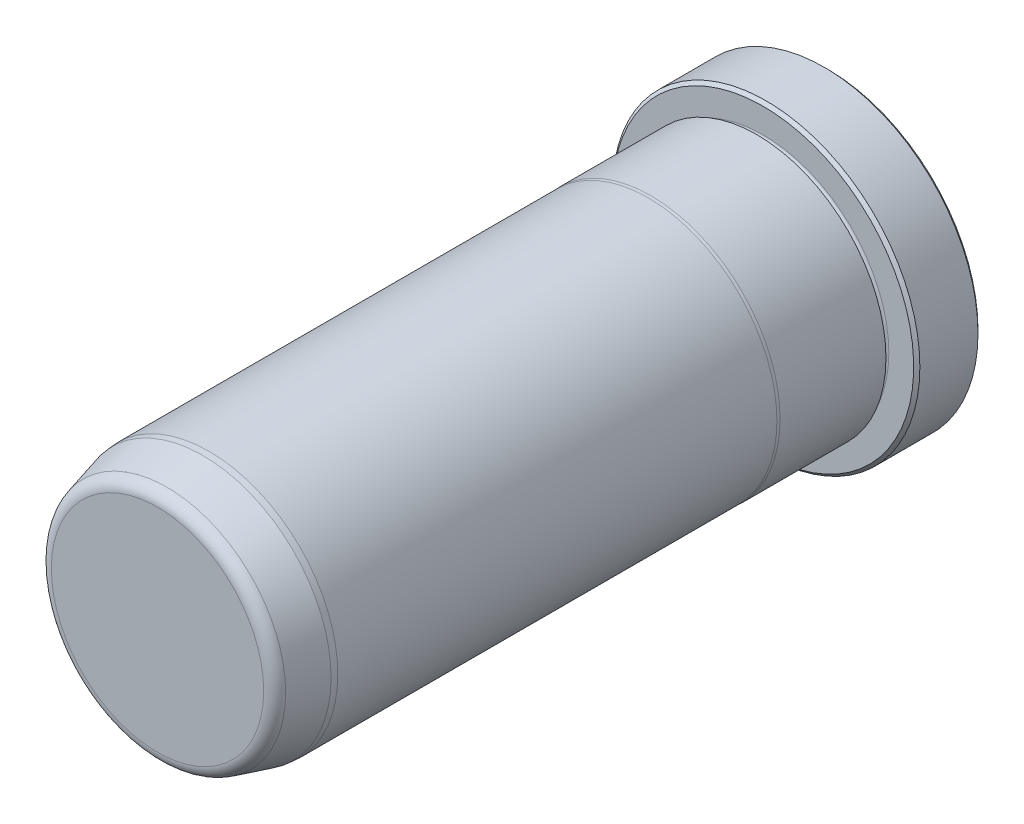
from build123d import *

# Parameters (mm, degrees)
FILLET6_R     = 1.5875
CHAMFER1_SIZE = 0.381


with BuildPart() as part:
    # Sketch1 → Revolve1 (revolve)
    with BuildSketch(Plane(origin=(0, 0, 0), x_dir=(0, 0, -1), z_dir=(1, 0, 0)), mode=Mode.PRIVATE) as revolve1_sk:
        with BuildLine():
            Line((0, 0), (0, 18.923))
            Line((0, 18.923), (-7.9248, 18.923))
            Line((-7.9248, 18.923), (-7.9248, 15.4813))
            ThreePointArc((-7.9248, 15.4813), (-8.3058, 15.1003), (-8.6868, 15.4813))
            Line((-8.6868, 15.4813), (-8.6868, 15.8877))
            Line((-8.6868, 15.8877), (-21.734763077, 15.8877))
            Line((-21.734763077, 15.8877), (-22.098, 15.8623))
            Line((-22.098, 15.8623), (-76.2, 15.8623))
            Line((-76.2, 15.8623), (-76.962, 15.795633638))
            Line((-76.962, 15.795633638), (-82.55, 14.298333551))
            Line((-82.55, 14.298333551), (-82.55, 0))
            Line((-82.55, 0), (0, 0))
        make_face()
    revolve(revolve1_sk.sketch.rotate(Axis((0, 0, 0), (0, 0, -1)), 90), axis=Axis((0, 0, 0), (0, 0, -1)))

    # Fillet6
    fillet6_edges = [part.edges().sort_by_distance(p)[0] for p in [
        (-14.298333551, 0, 82.55),
    ]]
    fillet(fillet6_edges, radius=FILLET6_R)

    # Chamfer1
    chamfer1_edges = [part.edges().sort_by_distance(p)[0] for p in [
        (-18.923, 0, 7.9248),
        (-18.923, 0, 0),
    ]]
    chamfer(chamfer1_edges, length=CHAMFER1_SIZE)


solid = part.part
